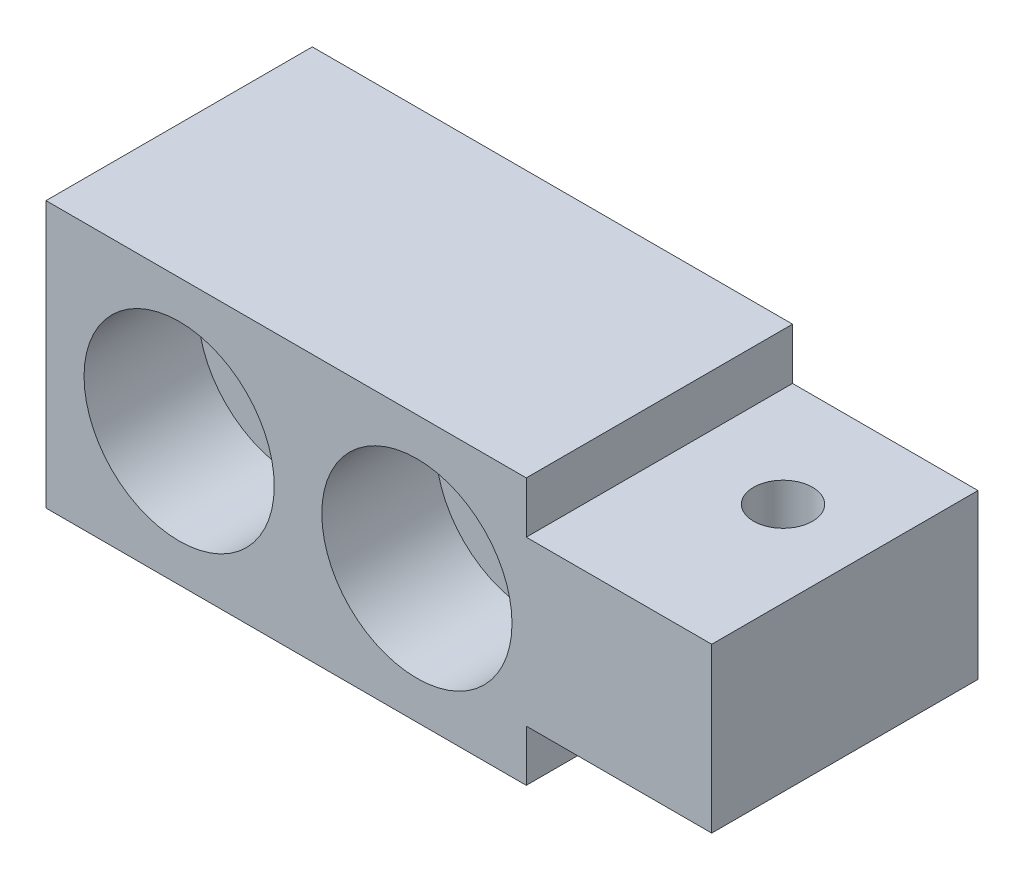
ISO-10303-21;
HEADER;
FILE_DESCRIPTION(('STEP AP214'),'2;1');
FILE_NAME('part.step','',(''),(''),'','','');
FILE_SCHEMA(('AUTOMOTIVE_DESIGN { 1 0 10303 214 1 1 1 1 }'));
ENDSEC;
DATA;
#1=APPLICATION_CONTEXT('core data for automotive mechanical design processes');
#2=APPLICATION_PROTOCOL_DEFINITION('international standard','automotive_design',2000,#1);
#3=PRODUCT_CONTEXT('',#1,'mechanical');
#4=PRODUCT('Part','Part','',(#3));
#5=PRODUCT_RELATED_PRODUCT_CATEGORY('part','',(#4));
#6=PRODUCT_DEFINITION_FORMATION('','',#4);
#7=PRODUCT_DEFINITION_CONTEXT('part definition',#1,'design');
#8=PRODUCT_DEFINITION('design','',#6,#7);
#9=PRODUCT_DEFINITION_SHAPE('','',#8);
#10=(LENGTH_UNIT() NAMED_UNIT(*) SI_UNIT(.MILLI.,.METRE.));
#11=(NAMED_UNIT(*) PLANE_ANGLE_UNIT() SI_UNIT($,.RADIAN.));
#12=(NAMED_UNIT(*) SI_UNIT($,.STERADIAN.) SOLID_ANGLE_UNIT());
#13=UNCERTAINTY_MEASURE_WITH_UNIT(LENGTH_MEASURE(1.E-05),#10,'distance_accuracy_value','');
#14=(GEOMETRIC_REPRESENTATION_CONTEXT(3) GLOBAL_UNCERTAINTY_ASSIGNED_CONTEXT((#13)) GLOBAL_UNIT_ASSIGNED_CONTEXT((#10,
#11,#12)) REPRESENTATION_CONTEXT('',''));
#15=CARTESIAN_POINT('',(0.,0.,0.));
#16=DIRECTION('',(0.,0.,1.));
#17=DIRECTION('',(1.,0.,0.));
#18=AXIS2_PLACEMENT_3D('',#15,#16,#17);
#19=CARTESIAN_POINT('',(56.,14.,28.));
#20=DIRECTION('',(0.,0.,-1.));
#21=DIRECTION('',(0.,-1.,0.));
#22=AXIS2_PLACEMENT_3D('',#19,#20,#21);
#23=PLANE('',#22);
#24=CARTESIAN_POINT('',(0.,0.,28.));
#25=DIRECTION('',(0.,0.,1.));
#26=DIRECTION('',(-1.,0.,0.));
#27=AXIS2_PLACEMENT_3D('',#24,#25,#26);
#28=CIRCLE('',#27,10.);
#29=CARTESIAN_POINT('',(-10.,0.,28.));
#30=VERTEX_POINT('',#29);
#31=EDGE_CURVE('E147',#30,#30,#28,.T.);
#32=ORIENTED_EDGE('',*,*,#31,.F.);
#33=EDGE_LOOP('',(#32));
#34=FACE_BOUND('',#33,.T.);
#35=DIRECTION('',(0.,1.,0.));
#36=VECTOR('',#35,1.);
#37=CARTESIAN_POINT('',(36.5,8.6,28.));
#38=LINE('',#37,#36);
#39=CARTESIAN_POINT('',(36.5,8.6,28.));
#40=VERTEX_POINT('',#39);
#41=CARTESIAN_POINT('',(36.5,14.,28.));
#42=VERTEX_POINT('',#41);
#43=EDGE_CURVE('E88',#40,#42,#38,.T.);
#44=ORIENTED_EDGE('',*,*,#43,.T.);
#45=DIRECTION('',(-1.,0.,0.));
#46=VECTOR('',#45,1.);
#47=CARTESIAN_POINT('',(56.,14.,28.));
#48=LINE('',#47,#46);
#49=CARTESIAN_POINT('',(-14.,14.,28.));
#50=VERTEX_POINT('',#49);
#51=EDGE_CURVE('E22',#42,#50,#48,.T.);
#52=ORIENTED_EDGE('',*,*,#51,.T.);
#53=DIRECTION('',(0.,-1.,0.));
#54=VECTOR('',#53,1.);
#55=CARTESIAN_POINT('',(-14.,14.,28.));
#56=LINE('',#55,#54);
#57=CARTESIAN_POINT('',(-14.,-14.,28.));
#58=VERTEX_POINT('',#57);
#59=EDGE_CURVE('E129',#50,#58,#56,.T.);
#60=ORIENTED_EDGE('',*,*,#59,.T.);
#61=DIRECTION('',(-1.,0.,0.));
#62=VECTOR('',#61,1.);
#63=CARTESIAN_POINT('',(56.,-14.,28.));
#64=LINE('',#63,#62);
#65=CARTESIAN_POINT('',(36.5,-14.,28.));
#66=VERTEX_POINT('',#65);
#67=EDGE_CURVE('E140',#66,#58,#64,.T.);
#68=ORIENTED_EDGE('',*,*,#67,.F.);
#69=DIRECTION('',(0.,-1.,0.));
#70=VECTOR('',#69,1.);
#71=CARTESIAN_POINT('',(36.5,-8.6,28.));
#72=LINE('',#71,#70);
#73=CARTESIAN_POINT('',(36.5,-8.6,28.));
#74=VERTEX_POINT('',#73);
#75=EDGE_CURVE('E108',#74,#66,#72,.T.);
#76=ORIENTED_EDGE('',*,*,#75,.F.);
#77=DIRECTION('',(1.,0.,0.));
#78=VECTOR('',#77,1.);
#79=CARTESIAN_POINT('',(36.5,-8.6,28.));
#80=LINE('',#79,#78);
#81=CARTESIAN_POINT('',(56.,-8.6,28.));
#82=VERTEX_POINT('',#81);
#83=EDGE_CURVE('E110',#74,#82,#80,.T.);
#84=ORIENTED_EDGE('',*,*,#83,.T.);
#85=DIRECTION('',(0.,-1.,0.));
#86=VECTOR('',#85,1.);
#87=CARTESIAN_POINT('',(56.,14.,28.));
#88=LINE('',#87,#86);
#89=CARTESIAN_POINT('',(56.,8.6,28.));
#90=VERTEX_POINT('',#89);
#91=EDGE_CURVE('E99',#90,#82,#88,.T.);
#92=ORIENTED_EDGE('',*,*,#91,.F.);
#93=DIRECTION('',(1.,0.,0.));
#94=VECTOR('',#93,1.);
#95=CARTESIAN_POINT('',(36.5,8.6,28.));
#96=LINE('',#95,#94);
#97=EDGE_CURVE('E82',#40,#90,#96,.T.);
#98=ORIENTED_EDGE('',*,*,#97,.F.);
#99=EDGE_LOOP('',(#44,#52,#60,#68,#76,#84,#92,#98));
#100=FACE_BOUND('',#99,.T.);
#101=CARTESIAN_POINT('',(25.,0.,28.));
#102=DIRECTION('',(0.,0.,1.));
#103=DIRECTION('',(-1.,0.,0.));
#104=AXIS2_PLACEMENT_3D('',#101,#102,#103);
#105=CIRCLE('',#104,10.);
#106=CARTESIAN_POINT('',(15.,0.,28.));
#107=VERTEX_POINT('',#106);
#108=EDGE_CURVE('E162',#107,#107,#105,.T.);
#109=ORIENTED_EDGE('',*,*,#108,.F.);
#110=EDGE_LOOP('',(#109));
#111=FACE_BOUND('',#110,.T.);
#112=ADVANCED_FACE('F14',(#34,#100,#111),#23,.F.);
#113=CARTESIAN_POINT('',(56.,-14.,0.));
#114=DIRECTION('',(0.,0.,1.));
#115=DIRECTION('',(0.,1.,0.));
#116=AXIS2_PLACEMENT_3D('',#113,#114,#115);
#117=PLANE('',#116);
#118=CARTESIAN_POINT('',(0.,0.,0.));
#119=DIRECTION('',(0.,0.,1.));
#120=DIRECTION('',(0.,1.,0.));
#121=AXIS2_PLACEMENT_3D('',#118,#119,#120);
#122=CIRCLE('',#121,6.5);
#123=CARTESIAN_POINT('',(0.,6.5,0.));
#124=VERTEX_POINT('',#123);
#125=EDGE_CURVE('E145',#124,#124,#122,.F.);
#126=ORIENTED_EDGE('',*,*,#125,.F.);
#127=EDGE_LOOP('',(#126));
#128=FACE_BOUND('',#127,.T.);
#129=DIRECTION('',(0.,1.,0.));
#130=VECTOR('',#129,1.);
#131=CARTESIAN_POINT('',(36.5,8.6,0.));
#132=LINE('',#131,#130);
#133=CARTESIAN_POINT('',(36.5,8.6,0.));
#134=VERTEX_POINT('',#133);
#135=CARTESIAN_POINT('',(36.5,14.,0.));
#136=VERTEX_POINT('',#135);
#137=EDGE_CURVE('E100',#134,#136,#132,.T.);
#138=ORIENTED_EDGE('',*,*,#137,.F.);
#139=DIRECTION('',(1.,0.,0.));
#140=VECTOR('',#139,1.);
#141=CARTESIAN_POINT('',(36.5,8.6,0.));
#142=LINE('',#141,#140);
#143=CARTESIAN_POINT('',(56.,8.6,0.));
#144=VERTEX_POINT('',#143);
#145=EDGE_CURVE('E83',#134,#144,#142,.T.);
#146=ORIENTED_EDGE('',*,*,#145,.T.);
#147=DIRECTION('',(0.,1.,0.));
#148=VECTOR('',#147,1.);
#149=CARTESIAN_POINT('',(56.,-14.,0.));
#150=LINE('',#149,#148);
#151=CARTESIAN_POINT('',(56.,-8.6,0.));
#152=VERTEX_POINT('',#151);
#153=EDGE_CURVE('E132',#152,#144,#150,.T.);
#154=ORIENTED_EDGE('',*,*,#153,.F.);
#155=DIRECTION('',(1.,0.,0.));
#156=VECTOR('',#155,1.);
#157=CARTESIAN_POINT('',(36.5,-8.6,0.));
#158=LINE('',#157,#156);
#159=CARTESIAN_POINT('',(36.5,-8.6,0.));
#160=VERTEX_POINT('',#159);
#161=EDGE_CURVE('E38',#160,#152,#158,.T.);
#162=ORIENTED_EDGE('',*,*,#161,.F.);
#163=DIRECTION('',(0.,-1.,0.));
#164=VECTOR('',#163,1.);
#165=CARTESIAN_POINT('',(36.5,-8.6,0.));
#166=LINE('',#165,#164);
#167=CARTESIAN_POINT('',(36.5,-14.,0.));
#168=VERTEX_POINT('',#167);
#169=EDGE_CURVE('E112',#160,#168,#166,.T.);
#170=ORIENTED_EDGE('',*,*,#169,.T.);
#171=DIRECTION('',(-1.,0.,0.));
#172=VECTOR('',#171,1.);
#173=CARTESIAN_POINT('',(56.,-14.,0.));
#174=LINE('',#173,#172);
#175=CARTESIAN_POINT('',(-14.,-14.,0.));
#176=VERTEX_POINT('',#175);
#177=EDGE_CURVE('E138',#168,#176,#174,.T.);
#178=ORIENTED_EDGE('',*,*,#177,.T.);
#179=DIRECTION('',(0.,1.,0.));
#180=VECTOR('',#179,1.);
#181=CARTESIAN_POINT('',(-14.,-14.,0.));
#182=LINE('',#181,#180);
#183=CARTESIAN_POINT('',(-14.,14.,0.));
#184=VERTEX_POINT('',#183);
#185=EDGE_CURVE('E123',#176,#184,#182,.T.);
#186=ORIENTED_EDGE('',*,*,#185,.T.);
#187=DIRECTION('',(-1.,0.,0.));
#188=VECTOR('',#187,1.);
#189=CARTESIAN_POINT('',(56.,14.,0.));
#190=LINE('',#189,#188);
#191=EDGE_CURVE('E136',#136,#184,#190,.T.);
#192=ORIENTED_EDGE('',*,*,#191,.F.);
#193=EDGE_LOOP('',(#138,#146,#154,#162,#170,#178,#186,#192));
#194=FACE_BOUND('',#193,.T.);
#195=CARTESIAN_POINT('',(25.,0.,0.));
#196=DIRECTION('',(0.,0.,1.));
#197=DIRECTION('',(0.,1.,0.));
#198=AXIS2_PLACEMENT_3D('',#195,#196,#197);
#199=CIRCLE('',#198,6.5);
#200=CARTESIAN_POINT('',(25.,6.5,0.));
#201=VERTEX_POINT('',#200);
#202=EDGE_CURVE('E17',#201,#201,#199,.F.);
#203=ORIENTED_EDGE('',*,*,#202,.F.);
#204=EDGE_LOOP('',(#203));
#205=FACE_BOUND('',#204,.T.);
#206=ADVANCED_FACE('F189',(#128,#194,#205),#117,.F.);
#207=CARTESIAN_POINT('',(56.,14.,28.));
#208=DIRECTION('',(0.,1.,0.));
#209=DIRECTION('',(0.,0.,-1.));
#210=AXIS2_PLACEMENT_3D('',#207,#208,#209);
#211=PLANE('',#210);
#212=ORIENTED_EDGE('',*,*,#51,.F.);
#213=DIRECTION('',(0.,0.,-1.));
#214=VECTOR('',#213,1.);
#215=CARTESIAN_POINT('',(36.5,14.,28.));
#216=LINE('',#215,#214);
#217=EDGE_CURVE('E91',#42,#136,#216,.T.);
#218=ORIENTED_EDGE('',*,*,#217,.T.);
#219=ORIENTED_EDGE('',*,*,#191,.T.);
#220=DIRECTION('',(0.,0.,-1.));
#221=VECTOR('',#220,1.);
#222=CARTESIAN_POINT('',(-14.,14.,28.));
#223=LINE('',#222,#221);
#224=EDGE_CURVE('E120',#50,#184,#223,.T.);
#225=ORIENTED_EDGE('',*,*,#224,.F.);
#226=EDGE_LOOP('',(#212,#218,#219,#225));
#227=FACE_BOUND('',#226,.T.);
#228=ADVANCED_FACE('F195',(#227),#211,.T.);
#229=CARTESIAN_POINT('',(56.,14.,0.));
#230=DIRECTION('',(1.,0.,0.));
#231=DIRECTION('',(0.,1.,0.));
#232=AXIS2_PLACEMENT_3D('',#229,#230,#231);
#233=PLANE('',#232);
#234=DIRECTION('',(0.,0.,-1.));
#235=VECTOR('',#234,1.);
#236=CARTESIAN_POINT('',(56.,8.6,0.));
#237=LINE('',#236,#235);
#238=EDGE_CURVE('E30',#90,#144,#237,.T.);
#239=ORIENTED_EDGE('',*,*,#238,.F.);
#240=ORIENTED_EDGE('',*,*,#91,.T.);
#241=DIRECTION('',(0.,0.,-1.));
#242=VECTOR('',#241,1.);
#243=CARTESIAN_POINT('',(56.,-8.6,0.));
#244=LINE('',#243,#242);
#245=EDGE_CURVE('E9',#82,#152,#244,.T.);
#246=ORIENTED_EDGE('',*,*,#245,.T.);
#247=ORIENTED_EDGE('',*,*,#153,.T.);
#248=EDGE_LOOP('',(#239,#240,#246,#247));
#249=FACE_BOUND('',#248,.T.);
#250=ADVANCED_FACE('F202',(#249),#233,.T.);
#251=CARTESIAN_POINT('',(56.,-14.,0.));
#252=DIRECTION('',(0.,-1.,0.));
#253=DIRECTION('',(1.,0.,0.));
#254=AXIS2_PLACEMENT_3D('',#251,#252,#253);
#255=PLANE('',#254);
#256=DIRECTION('',(0.,0.,-1.));
#257=VECTOR('',#256,1.);
#258=CARTESIAN_POINT('',(36.5,-14.,0.));
#259=LINE('',#258,#257);
#260=EDGE_CURVE('E118',#66,#168,#259,.T.);
#261=ORIENTED_EDGE('',*,*,#260,.F.);
#262=ORIENTED_EDGE('',*,*,#67,.T.);
#263=DIRECTION('',(0.,0.,1.));
#264=VECTOR('',#263,1.);
#265=CARTESIAN_POINT('',(-14.,-14.,0.));
#266=LINE('',#265,#264);
#267=EDGE_CURVE('E126',#176,#58,#266,.T.);
#268=ORIENTED_EDGE('',*,*,#267,.F.);
#269=ORIENTED_EDGE('',*,*,#177,.F.);
#270=EDGE_LOOP('',(#261,#262,#268,#269));
#271=FACE_BOUND('',#270,.T.);
#272=ADVANCED_FACE('F207',(#271),#255,.T.);
#273=CARTESIAN_POINT('',(-14.,14.,0.));
#274=DIRECTION('',(1.,0.,0.));
#275=DIRECTION('',(0.,1.,0.));
#276=AXIS2_PLACEMENT_3D('',#273,#274,#275);
#277=PLANE('',#276);
#278=ORIENTED_EDGE('',*,*,#224,.T.);
#279=ORIENTED_EDGE('',*,*,#185,.F.);
#280=ORIENTED_EDGE('',*,*,#267,.T.);
#281=ORIENTED_EDGE('',*,*,#59,.F.);
#282=EDGE_LOOP('',(#278,#279,#280,#281));
#283=FACE_BOUND('',#282,.T.);
#284=ADVANCED_FACE('F209',(#283),#277,.F.);
#285=CARTESIAN_POINT('',(36.5,-8.6,0.));
#286=DIRECTION('',(-1.,0.,0.));
#287=DIRECTION('',(0.,-1.,0.));
#288=AXIS2_PLACEMENT_3D('',#285,#286,#287);
#289=PLANE('',#288);
#290=ORIENTED_EDGE('',*,*,#260,.T.);
#291=ORIENTED_EDGE('',*,*,#169,.F.);
#292=DIRECTION('',(0.,0.,1.));
#293=VECTOR('',#292,1.);
#294=CARTESIAN_POINT('',(36.5,-8.6,0.));
#295=LINE('',#294,#293);
#296=EDGE_CURVE('E116',#160,#74,#295,.T.);
#297=ORIENTED_EDGE('',*,*,#296,.T.);
#298=ORIENTED_EDGE('',*,*,#75,.T.);
#299=EDGE_LOOP('',(#290,#291,#297,#298));
#300=FACE_BOUND('',#299,.T.);
#301=ADVANCED_FACE('F216',(#300),#289,.F.);
#302=CARTESIAN_POINT('',(36.5,-8.6,0.));
#303=DIRECTION('',(0.,-1.,0.));
#304=DIRECTION('',(1.,0.,0.));
#305=AXIS2_PLACEMENT_3D('',#302,#303,#304);
#306=PLANE('',#305);
#307=CARTESIAN_POINT('',(47.,-8.6,11.5));
#308=DIRECTION('',(0.,-1.,0.));
#309=DIRECTION('',(1.,0.,0.));
#310=AXIS2_PLACEMENT_3D('',#307,#308,#309);
#311=CIRCLE('',#310,3.1);
#312=CARTESIAN_POINT('',(50.1,-8.6,11.5));
#313=VERTEX_POINT('',#312);
#314=EDGE_CURVE('E144',#313,#313,#311,.T.);
#315=ORIENTED_EDGE('',*,*,#314,.F.);
#316=EDGE_LOOP('',(#315));
#317=FACE_BOUND('',#316,.T.);
#318=ORIENTED_EDGE('',*,*,#83,.F.);
#319=ORIENTED_EDGE('',*,*,#296,.F.);
#320=ORIENTED_EDGE('',*,*,#161,.T.);
#321=ORIENTED_EDGE('',*,*,#245,.F.);
#322=EDGE_LOOP('',(#318,#319,#320,#321));
#323=FACE_BOUND('',#322,.T.);
#324=ADVANCED_FACE('F234',(#317,#323),#306,.T.);
#325=CARTESIAN_POINT('',(36.5,8.6,0.));
#326=DIRECTION('',(1.,0.,0.));
#327=DIRECTION('',(0.,1.,0.));
#328=AXIS2_PLACEMENT_3D('',#325,#326,#327);
#329=PLANE('',#328);
#330=ORIENTED_EDGE('',*,*,#43,.F.);
#331=DIRECTION('',(0.,0.,1.));
#332=VECTOR('',#331,1.);
#333=CARTESIAN_POINT('',(36.5,8.6,0.));
#334=LINE('',#333,#332);
#335=EDGE_CURVE('E78',#134,#40,#334,.T.);
#336=ORIENTED_EDGE('',*,*,#335,.F.);
#337=ORIENTED_EDGE('',*,*,#137,.T.);
#338=ORIENTED_EDGE('',*,*,#217,.F.);
#339=EDGE_LOOP('',(#330,#336,#337,#338));
#340=FACE_BOUND('',#339,.T.);
#341=ADVANCED_FACE('F89',(#340),#329,.T.);
#342=CARTESIAN_POINT('',(36.5,8.6,0.));
#343=DIRECTION('',(0.,-1.,0.));
#344=DIRECTION('',(1.,0.,0.));
#345=AXIS2_PLACEMENT_3D('',#342,#343,#344);
#346=PLANE('',#345);
#347=CARTESIAN_POINT('',(47.,8.6,11.5));
#348=DIRECTION('',(0.,-1.,0.));
#349=DIRECTION('',(1.,0.,0.));
#350=AXIS2_PLACEMENT_3D('',#347,#348,#349);
#351=CIRCLE('',#350,3.1);
#352=CARTESIAN_POINT('',(50.1,8.6,11.5));
#353=VERTEX_POINT('',#352);
#354=EDGE_CURVE('E94',#353,#353,#351,.T.);
#355=ORIENTED_EDGE('',*,*,#354,.T.);
#356=EDGE_LOOP('',(#355));
#357=FACE_BOUND('',#356,.T.);
#358=ORIENTED_EDGE('',*,*,#238,.T.);
#359=ORIENTED_EDGE('',*,*,#145,.F.);
#360=ORIENTED_EDGE('',*,*,#335,.T.);
#361=ORIENTED_EDGE('',*,*,#97,.T.);
#362=EDGE_LOOP('',(#358,#359,#360,#361));
#363=FACE_BOUND('',#362,.T.);
#364=ADVANCED_FACE('F80',(#357,#363),#346,.F.);
#365=CARTESIAN_POINT('',(47.,14.,11.5));
#366=DIRECTION('',(0.,-1.,0.));
#367=DIRECTION('',(1.,0.,0.));
#368=AXIS2_PLACEMENT_3D('',#365,#366,#367);
#369=CYLINDRICAL_SURFACE('',#368,3.1);
#370=ORIENTED_EDGE('',*,*,#314,.T.);
#371=EDGE_LOOP('',(#370));
#372=FACE_BOUND('',#371,.T.);
#373=ORIENTED_EDGE('',*,*,#354,.F.);
#374=EDGE_LOOP('',(#373));
#375=FACE_BOUND('',#374,.T.);
#376=ADVANCED_FACE('F248',(#372,#375),#369,.F.);
#377=CARTESIAN_POINT('',(0.,0.,28.));
#378=DIRECTION('',(0.,0.,1.));
#379=DIRECTION('',(-1.,0.,0.));
#380=AXIS2_PLACEMENT_3D('',#377,#378,#379);
#381=CYLINDRICAL_SURFACE('',#380,6.5);
#382=CARTESIAN_POINT('',(0.,0.,16.));
#383=DIRECTION('',(0.,0.,1.));
#384=DIRECTION('',(-1.,0.,0.));
#385=AXIS2_PLACEMENT_3D('',#382,#383,#384);
#386=CIRCLE('',#385,6.5);
#387=CARTESIAN_POINT('',(-6.5,0.,16.));
#388=VERTEX_POINT('',#387);
#389=EDGE_CURVE('E157',#388,#388,#386,.T.);
#390=ORIENTED_EDGE('',*,*,#389,.T.);
#391=EDGE_LOOP('',(#390));
#392=FACE_BOUND('',#391,.T.);
#393=ORIENTED_EDGE('',*,*,#125,.T.);
#394=EDGE_LOOP('',(#393));
#395=FACE_BOUND('',#394,.T.);
#396=ADVANCED_FACE('F253',(#392,#395),#381,.F.);
#397=CARTESIAN_POINT('',(0.,0.,28.));
#398=DIRECTION('',(0.,0.,1.));
#399=DIRECTION('',(-1.,0.,0.));
#400=AXIS2_PLACEMENT_3D('',#397,#398,#399);
#401=CYLINDRICAL_SURFACE('',#400,10.);
#402=ORIENTED_EDGE('',*,*,#31,.T.);
#403=EDGE_LOOP('',(#402));
#404=FACE_BOUND('',#403,.T.);
#405=CARTESIAN_POINT('',(0.,0.,16.));
#406=DIRECTION('',(0.,0.,1.));
#407=DIRECTION('',(-1.,0.,0.));
#408=AXIS2_PLACEMENT_3D('',#405,#406,#407);
#409=CIRCLE('',#408,10.);
#410=CARTESIAN_POINT('',(-10.,0.,16.));
#411=VERTEX_POINT('',#410);
#412=EDGE_CURVE('E152',#411,#411,#409,.T.);
#413=ORIENTED_EDGE('',*,*,#412,.F.);
#414=EDGE_LOOP('',(#413));
#415=FACE_BOUND('',#414,.T.);
#416=ADVANCED_FACE('F255',(#404,#415),#401,.F.);
#417=CARTESIAN_POINT('',(0.,-6.5,16.));
#418=DIRECTION('',(0.,0.,1.));
#419=DIRECTION('',(-1.,0.,0.));
#420=AXIS2_PLACEMENT_3D('',#417,#418,#419);
#421=PLANE('',#420);
#422=ORIENTED_EDGE('',*,*,#412,.T.);
#423=EDGE_LOOP('',(#422));
#424=FACE_BOUND('',#423,.T.);
#425=ORIENTED_EDGE('',*,*,#389,.F.);
#426=EDGE_LOOP('',(#425));
#427=FACE_BOUND('',#426,.T.);
#428=ADVANCED_FACE('F258',(#424,#427),#421,.T.);
#429=CARTESIAN_POINT('',(25.,0.,28.));
#430=DIRECTION('',(0.,0.,1.));
#431=DIRECTION('',(-1.,0.,0.));
#432=AXIS2_PLACEMENT_3D('',#429,#430,#431);
#433=CYLINDRICAL_SURFACE('',#432,6.5);
#434=CARTESIAN_POINT('',(25.,0.,16.));
#435=DIRECTION('',(0.,0.,1.));
#436=DIRECTION('',(-1.,0.,0.));
#437=AXIS2_PLACEMENT_3D('',#434,#435,#436);
#438=CIRCLE('',#437,6.5);
#439=CARTESIAN_POINT('',(18.5,0.,16.));
#440=VERTEX_POINT('',#439);
#441=EDGE_CURVE('E168',#440,#440,#438,.T.);
#442=ORIENTED_EDGE('',*,*,#441,.T.);
#443=EDGE_LOOP('',(#442));
#444=FACE_BOUND('',#443,.T.);
#445=ORIENTED_EDGE('',*,*,#202,.T.);
#446=EDGE_LOOP('',(#445));
#447=FACE_BOUND('',#446,.T.);
#448=ADVANCED_FACE('F172',(#444,#447),#433,.F.);
#449=CARTESIAN_POINT('',(25.,0.,28.));
#450=DIRECTION('',(0.,0.,1.));
#451=DIRECTION('',(-1.,0.,0.));
#452=AXIS2_PLACEMENT_3D('',#449,#450,#451);
#453=CYLINDRICAL_SURFACE('',#452,10.);
#454=ORIENTED_EDGE('',*,*,#108,.T.);
#455=EDGE_LOOP('',(#454));
#456=FACE_BOUND('',#455,.T.);
#457=CARTESIAN_POINT('',(25.,0.,16.));
#458=DIRECTION('',(0.,0.,1.));
#459=DIRECTION('',(-1.,0.,0.));
#460=AXIS2_PLACEMENT_3D('',#457,#458,#459);
#461=CIRCLE('',#460,10.);
#462=CARTESIAN_POINT('',(15.,0.,16.));
#463=VERTEX_POINT('',#462);
#464=EDGE_CURVE('E165',#463,#463,#461,.T.);
#465=ORIENTED_EDGE('',*,*,#464,.F.);
#466=EDGE_LOOP('',(#465));
#467=FACE_BOUND('',#466,.T.);
#468=ADVANCED_FACE('F177',(#456,#467),#453,.F.);
#469=CARTESIAN_POINT('',(25.,-6.5,16.));
#470=DIRECTION('',(0.,0.,1.));
#471=DIRECTION('',(-1.,0.,0.));
#472=AXIS2_PLACEMENT_3D('',#469,#470,#471);
#473=PLANE('',#472);
#474=ORIENTED_EDGE('',*,*,#464,.T.);
#475=EDGE_LOOP('',(#474));
#476=FACE_BOUND('',#475,.T.);
#477=ORIENTED_EDGE('',*,*,#441,.F.);
#478=EDGE_LOOP('',(#477));
#479=FACE_BOUND('',#478,.T.);
#480=ADVANCED_FACE('F175',(#476,#479),#473,.T.);
#481=CLOSED_SHELL('',(#112,#206,#228,#250,#272,#284,#301,#324,#341,#364,#376,#396,#416,#428,
#448,#468,#480));
#482=MANIFOLD_SOLID_BREP('B1',#481);
#483=ADVANCED_BREP_SHAPE_REPRESENTATION('',(#18,#482),#14);
#484=SHAPE_DEFINITION_REPRESENTATION(#9,#483);
ENDSEC;
END-ISO-10303-21;
